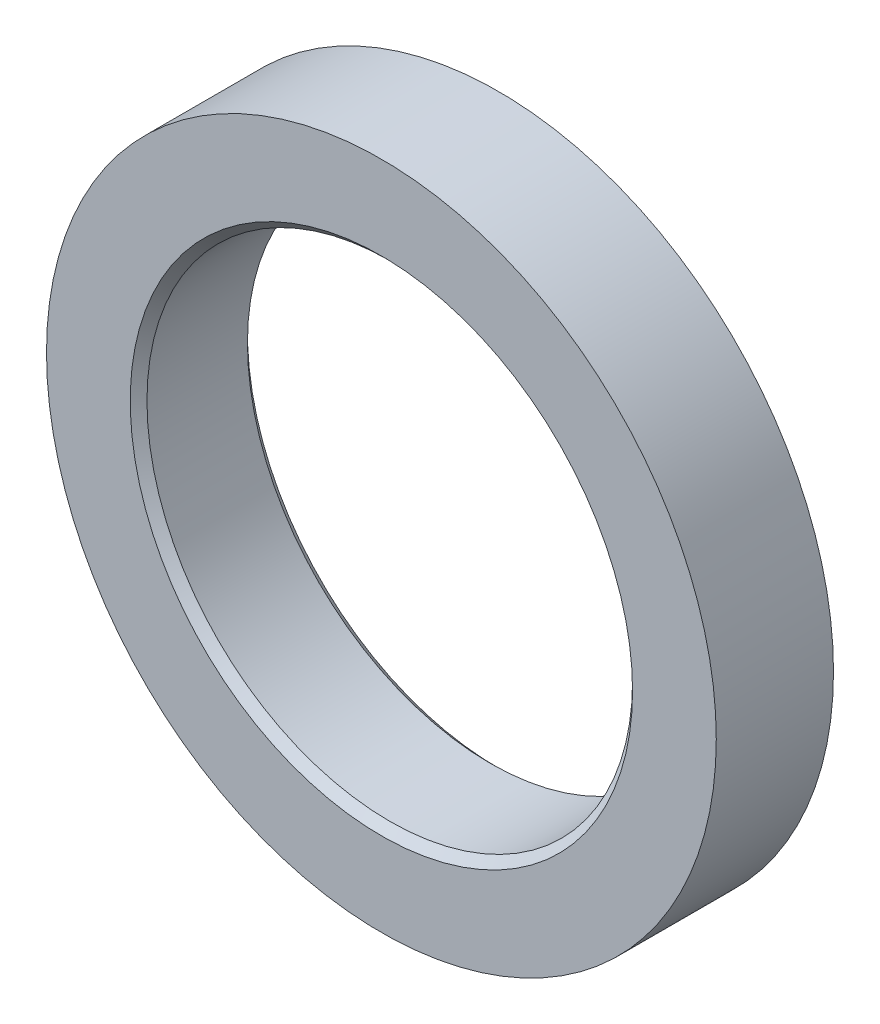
ISO-10303-21;
HEADER;
FILE_DESCRIPTION(('STEP AP214'),'2;1');
FILE_NAME('part.step','',(''),(''),'','','');
FILE_SCHEMA(('AUTOMOTIVE_DESIGN { 1 0 10303 214 1 1 1 1 }'));
ENDSEC;
DATA;
#1=APPLICATION_CONTEXT('core data for automotive mechanical design processes');
#2=APPLICATION_PROTOCOL_DEFINITION('international standard','automotive_design',2000,#1);
#3=PRODUCT_CONTEXT('',#1,'mechanical');
#4=PRODUCT('Part','Part','',(#3));
#5=PRODUCT_RELATED_PRODUCT_CATEGORY('part','',(#4));
#6=PRODUCT_DEFINITION_FORMATION('','',#4);
#7=PRODUCT_DEFINITION_CONTEXT('part definition',#1,'design');
#8=PRODUCT_DEFINITION('design','',#6,#7);
#9=PRODUCT_DEFINITION_SHAPE('','',#8);
#10=(LENGTH_UNIT() NAMED_UNIT(*) SI_UNIT(.MILLI.,.METRE.));
#11=(NAMED_UNIT(*) PLANE_ANGLE_UNIT() SI_UNIT($,.RADIAN.));
#12=(NAMED_UNIT(*) SI_UNIT($,.STERADIAN.) SOLID_ANGLE_UNIT());
#13=UNCERTAINTY_MEASURE_WITH_UNIT(LENGTH_MEASURE(1.E-05),#10,'distance_accuracy_value','');
#14=(GEOMETRIC_REPRESENTATION_CONTEXT(3) GLOBAL_UNCERTAINTY_ASSIGNED_CONTEXT((#13)) GLOBAL_UNIT_ASSIGNED_CONTEXT((#10,
#11,#12)) REPRESENTATION_CONTEXT('',''));
#15=CARTESIAN_POINT('',(0.,0.,0.));
#16=DIRECTION('',(0.,0.,1.));
#17=DIRECTION('',(1.,0.,0.));
#18=AXIS2_PLACEMENT_3D('',#15,#16,#17);
#19=CARTESIAN_POINT('',(0.,0.,1.778));
#20=DIRECTION('',(0.,0.,1.));
#21=DIRECTION('',(1.,0.,0.));
#22=AXIS2_PLACEMENT_3D('',#19,#20,#21);
#23=PLANE('',#22);
#24=CARTESIAN_POINT('',(0.,0.,1.778));
#25=DIRECTION('',(0.,0.,1.));
#26=DIRECTION('',(1.,0.,0.));
#27=AXIS2_PLACEMENT_3D('',#24,#25,#26);
#28=CIRCLE('',#27,3.81);
#29=CARTESIAN_POINT('',(3.81,0.,1.778));
#30=VERTEX_POINT('',#29);
#31=EDGE_CURVE('E42',#30,#30,#28,.F.);
#32=ORIENTED_EDGE('',*,*,#31,.T.);
#33=EDGE_LOOP('',(#32));
#34=FACE_BOUND('',#33,.T.);
#35=CARTESIAN_POINT('',(0.,0.,1.778));
#36=DIRECTION('',(0.,0.,1.));
#37=DIRECTION('',(1.,0.,0.));
#38=AXIS2_PLACEMENT_3D('',#35,#36,#37);
#39=CIRCLE('',#38,5.08);
#40=CARTESIAN_POINT('',(5.08,0.,1.778));
#41=VERTEX_POINT('',#40);
#42=EDGE_CURVE('E55',#41,#41,#39,.T.);
#43=ORIENTED_EDGE('',*,*,#42,.T.);
#44=EDGE_LOOP('',(#43));
#45=FACE_BOUND('',#44,.T.);
#46=ADVANCED_FACE('F35',(#34,#45),#23,.T.);
#47=CARTESIAN_POINT('',(0.,0.,0.));
#48=DIRECTION('',(0.,0.,1.));
#49=DIRECTION('',(1.,0.,0.));
#50=AXIS2_PLACEMENT_3D('',#47,#48,#49);
#51=PLANE('',#50);
#52=CARTESIAN_POINT('',(0.,0.,0.));
#53=DIRECTION('',(0.,0.,1.));
#54=DIRECTION('',(1.,0.,0.));
#55=AXIS2_PLACEMENT_3D('',#52,#53,#54);
#56=CIRCLE('',#55,3.81);
#57=CARTESIAN_POINT('',(3.81,0.,0.));
#58=VERTEX_POINT('',#57);
#59=EDGE_CURVE('E10',#58,#58,#56,.T.);
#60=ORIENTED_EDGE('',*,*,#59,.T.);
#61=EDGE_LOOP('',(#60));
#62=FACE_BOUND('',#61,.T.);
#63=CARTESIAN_POINT('',(0.,0.,0.));
#64=DIRECTION('',(0.,0.,1.));
#65=DIRECTION('',(1.,0.,0.));
#66=AXIS2_PLACEMENT_3D('',#63,#64,#65);
#67=CIRCLE('',#66,5.08);
#68=CARTESIAN_POINT('',(5.08,0.,0.));
#69=VERTEX_POINT('',#68);
#70=EDGE_CURVE('E56',#69,#69,#67,.T.);
#71=ORIENTED_EDGE('',*,*,#70,.F.);
#72=EDGE_LOOP('',(#71));
#73=FACE_BOUND('',#72,.T.);
#74=ADVANCED_FACE('F67',(#62,#73),#51,.F.);
#75=CARTESIAN_POINT('',(0.,0.,1.778));
#76=DIRECTION('',(0.,0.,-1.));
#77=DIRECTION('',(-1.,0.,0.));
#78=AXIS2_PLACEMENT_3D('',#75,#76,#77);
#79=CYLINDRICAL_SURFACE('',#78,5.08);
#80=ORIENTED_EDGE('',*,*,#42,.F.);
#81=EDGE_LOOP('',(#80));
#82=FACE_BOUND('',#81,.T.);
#83=ORIENTED_EDGE('',*,*,#70,.T.);
#84=EDGE_LOOP('',(#83));
#85=FACE_BOUND('',#84,.T.);
#86=ADVANCED_FACE('F63',(#82,#85),#79,.T.);
#87=CARTESIAN_POINT('',(0.,0.,1.778));
#88=DIRECTION('',(0.,0.,-1.));
#89=DIRECTION('',(-1.,0.,0.));
#90=AXIS2_PLACEMENT_3D('',#87,#88,#89);
#91=CYLINDRICAL_SURFACE('',#90,3.683);
#92=CARTESIAN_POINT('',(0.,0.,1.651));
#93=DIRECTION('',(0.,0.,1.));
#94=DIRECTION('',(1.,0.,0.));
#95=AXIS2_PLACEMENT_3D('',#92,#93,#94);
#96=CIRCLE('',#95,3.683);
#97=CARTESIAN_POINT('',(3.683,0.,1.651));
#98=VERTEX_POINT('',#97);
#99=EDGE_CURVE('E46',#98,#98,#96,.T.);
#100=ORIENTED_EDGE('',*,*,#99,.T.);
#101=EDGE_LOOP('',(#100));
#102=FACE_BOUND('',#101,.T.);
#103=CARTESIAN_POINT('',(0.,0.,0.127000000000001));
#104=DIRECTION('',(0.,0.,1.));
#105=DIRECTION('',(1.,0.,0.));
#106=AXIS2_PLACEMENT_3D('',#103,#104,#105);
#107=CIRCLE('',#106,3.683);
#108=CARTESIAN_POINT('',(3.683,0.,0.127000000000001));
#109=VERTEX_POINT('',#108);
#110=EDGE_CURVE('E50',#109,#109,#107,.F.);
#111=ORIENTED_EDGE('',*,*,#110,.T.);
#112=EDGE_LOOP('',(#111));
#113=FACE_BOUND('',#112,.T.);
#114=ADVANCED_FACE('F66',(#102,#113),#91,.F.);
#115=CARTESIAN_POINT('',(0.,0.,1.651));
#116=DIRECTION('',(0.,0.,1.));
#117=DIRECTION('',(1.,0.,0.));
#118=AXIS2_PLACEMENT_3D('',#115,#116,#117);
#119=CONICAL_SURFACE('',#118,3.683,0.785398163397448);
#120=ORIENTED_EDGE('',*,*,#31,.F.);
#121=EDGE_LOOP('',(#120));
#122=FACE_BOUND('',#121,.T.);
#123=ORIENTED_EDGE('',*,*,#99,.F.);
#124=EDGE_LOOP('',(#123));
#125=FACE_BOUND('',#124,.T.);
#126=ADVANCED_FACE('F78',(#122,#125),#119,.F.);
#127=CARTESIAN_POINT('',(0.,0.,0.));
#128=DIRECTION('',(0.,0.,-1.));
#129=DIRECTION('',(-1.,0.,0.));
#130=AXIS2_PLACEMENT_3D('',#127,#128,#129);
#131=CONICAL_SURFACE('',#130,3.81,0.785398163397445);
#132=ORIENTED_EDGE('',*,*,#110,.F.);
#133=EDGE_LOOP('',(#132));
#134=FACE_BOUND('',#133,.T.);
#135=ORIENTED_EDGE('',*,*,#59,.F.);
#136=EDGE_LOOP('',(#135));
#137=FACE_BOUND('',#136,.T.);
#138=ADVANCED_FACE('F37',(#134,#137),#131,.F.);
#139=CLOSED_SHELL('',(#46,#74,#86,#114,#126,#138));
#140=MANIFOLD_SOLID_BREP('B2',#139);
#141=ADVANCED_BREP_SHAPE_REPRESENTATION('',(#18,#140),#14);
#142=SHAPE_DEFINITION_REPRESENTATION(#9,#141);
ENDSEC;
END-ISO-10303-21;
